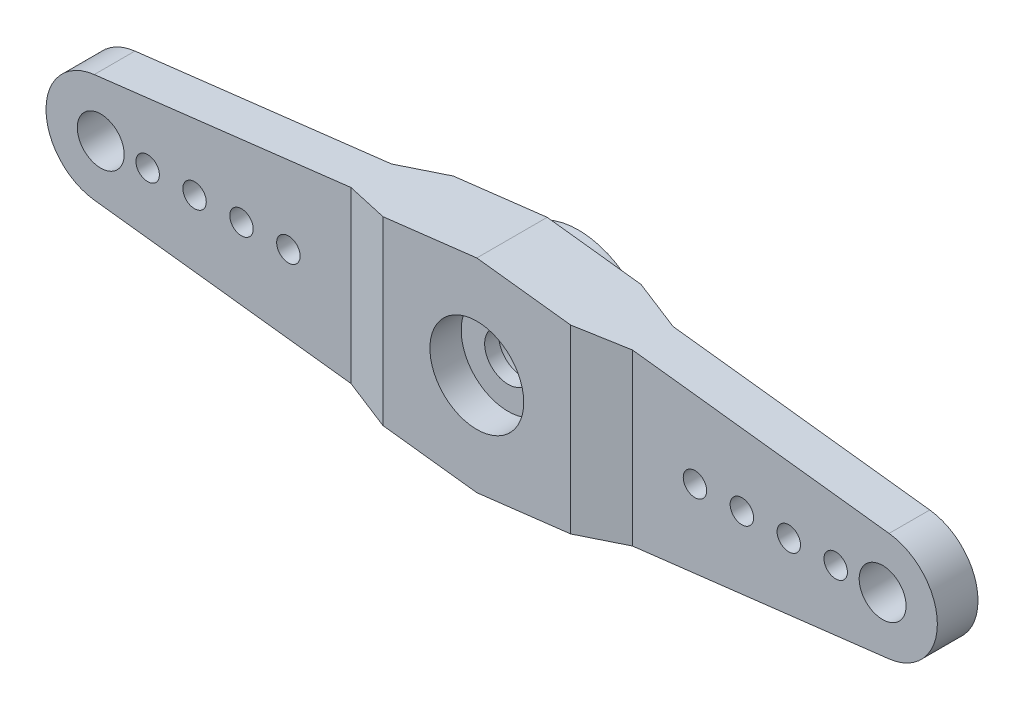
from build123d import *

# Parameters (mm, degrees)
SKIZZE1_R                            = 1.5
SKIZZE1_R_2                          = 0.75
AUFSATZ_LINEAR_AUSTRAGEN1_DEPTH      = 2.6
AUFSATZ_LINEAR_AUSTRAGEN2_DEPTH      = 0.95
AUFSATZ_LINEAR_AUSTRAGEN3_DEPTH      = 0.95
SCHNITT_LINEAR_AUSTRAGEN1_DEPTH      = 10
SCHNITT_LINEAR_AUSTRAGEN1_DEPTH_BACK = 10
SKIZZE5_R                            = 4.8
SKIZZE5_R_2                          = 3
AUFSATZ_LINEAR_AUSTRAGEN4_DEPTH      = 2
SCHNITT_LINEAR_START                 = -3.6
SKIZZE6_R                            = 3
SCHNITT_LINEAR_AUSTRAGEN2_DEPTH      = 3.6
SKIZZE7_R                            = 1.5
SCHNITT_LINEAR_AUSTRAGEN3_DEPTH      = 5.6
SKIZZE8_R                            = 3
SCHNITT_LINEAR_AUSTRAGEN4_DEPTH      = 2


with BuildPart() as part:
    # Skizze1 → Aufsatz-Linear austragen1 (new body)
    with BuildSketch(Plane.XY):
        with BuildLine():
            Line((0, 6.5), (-25.413623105, 3.475473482))
            ThreePointArc((-25.413623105, 3.475473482), (-28.5, 0), (-25.413623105, -3.475473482))
            Line((-25.413623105, -3.475473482), (0, -6.5))
            Line((0, -6.5), (25.413623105, -3.475473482))
            ThreePointArc((25.413623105, -3.475473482), (28.5, 0), (25.413623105, 3.475473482))
            Line((25.413623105, 3.475473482), (0, 6.5))
        make_face()
        with Locations((-25, 0)):
            Circle(SKIZZE1_R, mode=Mode.SUBTRACT)
        with Locations((-22, 0)):
            Circle(SKIZZE1_R_2, mode=Mode.SUBTRACT)
        with Locations((-19, 0)):
            Circle(SKIZZE1_R_2, mode=Mode.SUBTRACT)
        with Locations((-16, 0)):
            Circle(SKIZZE1_R_2, mode=Mode.SUBTRACT)
        with Locations((-13, 0)):
            Circle(SKIZZE1_R_2, mode=Mode.SUBTRACT)
        with Locations(Location((13, 0, 0), (0, 0, 180))):
            Circle(SKIZZE1_R_2, mode=Mode.SUBTRACT)
        with Locations(Location((16, 0, 0), (0, 0, 180))):
            Circle(SKIZZE1_R_2, mode=Mode.SUBTRACT)
        with Locations(Location((19, 0, 0), (0, 0, 180))):
            Circle(SKIZZE1_R_2, mode=Mode.SUBTRACT)
        with Locations(Location((22, 0, 0), (0, 0, 180))):
            Circle(SKIZZE1_R_2, mode=Mode.SUBTRACT)
        with Locations(Location((25, 0, 0), (0, 0, 180))):
            Circle(SKIZZE1_R, mode=Mode.SUBTRACT)
    extrude(amount=AUFSATZ_LINEAR_AUSTRAGEN1_DEPTH)

    # Skizze2 → Aufsatz-Linear austragen2 (add)
    with BuildSketch(Plane.XY.offset(2.6)):
        Polygon((0, 6.5), (-9, 5.428891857), (-9, -5.428891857), (0, -6.5), (9, -5.428891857), (9, 5.428891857), align=None)
    extrude(amount=AUFSATZ_LINEAR_AUSTRAGEN2_DEPTH)

    # Skizze3 → Aufsatz-Linear austragen3 (add)
    with BuildSketch(Plane(origin=(0, 0, 0), x_dir=(-1, 0, 0), z_dir=(0, 0, -1))):
        Polygon((-9, 5.428891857), (-9, -5.428891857), (0, -6.5), (9, -5.428891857), (9, 5.428891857), (0, 6.5), align=None)
    extrude(amount=AUFSATZ_LINEAR_AUSTRAGEN3_DEPTH)

    # Skizze4 → Schnitt-Linear austragen1 (cut, two sides: drawn at the far end of the back side and taken through both)
    with BuildSketch(Plane(origin=(0, 0, 0), x_dir=(1, 0, 0), z_dir=(0, 1, 0)).offset(-SCHNITT_LINEAR_AUSTRAGEN1_DEPTH_BACK)):
        Polygon((-9, 0.95), (-9, 0), (-6, 0.95), align=None)
        Polygon((9, 0), (9, 0.95), (6, 0.95), align=None)
        Polygon((6, -3.55), (9, -2.6), (9, -3.55), align=None)
        Polygon((-9, -3.55), (-9, -2.6), (-6, -3.55), align=None)
    extrude(amount=SCHNITT_LINEAR_AUSTRAGEN1_DEPTH + SCHNITT_LINEAR_AUSTRAGEN1_DEPTH_BACK, mode=Mode.SUBTRACT)

    # Skizze5 → Aufsatz-Linear austragen4 (add)
    with BuildSketch(Plane(origin=(0, 0, -0.95), x_dir=(-1, 0, 0), z_dir=(0, 0, -1))):
        Circle(SKIZZE5_R)
        Circle(SKIZZE5_R_2, mode=Mode.SUBTRACT)
    extrude(amount=AUFSATZ_LINEAR_AUSTRAGEN4_DEPTH)

    # Skizze6 → Schnitt-Linear austragen2 (cut)
    with BuildSketch(Plane(origin=(0, 0, -2.95), x_dir=(-1, 0, 0), z_dir=(0, 0, -1)).offset(SCHNITT_LINEAR_START)):
        Circle(SKIZZE6_R)
    extrude(amount=SCHNITT_LINEAR_AUSTRAGEN2_DEPTH, mode=Mode.SUBTRACT)

    # Skizze7 → Schnitt-Linear austragen3 (cut)
    with BuildSketch(Plane(origin=(0, 0, 0.65), x_dir=(-1, 0, 0), z_dir=(0, 0, -1))):
        Circle(SKIZZE7_R)
    extrude(amount=-SCHNITT_LINEAR_AUSTRAGEN3_DEPTH, mode=Mode.SUBTRACT)

    # Skizze8 → Schnitt-Linear austragen4 (cut)
    with BuildSketch(Plane.XY.offset(3.55)):
        with Locations(Location((0, 0, 0), (0, 0, 180))):
            Circle(SKIZZE8_R)
    extrude(amount=-SCHNITT_LINEAR_AUSTRAGEN4_DEPTH, mode=Mode.SUBTRACT)


solid = part.part
